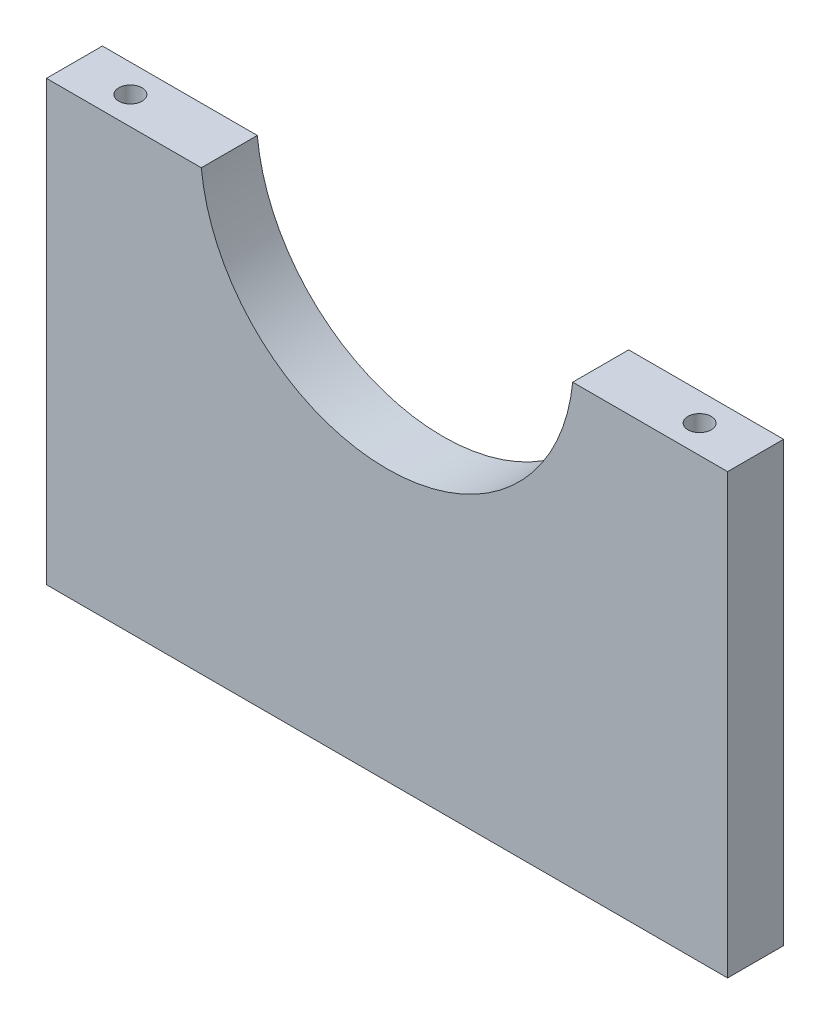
ISO-10303-21;
HEADER;
FILE_DESCRIPTION(('STEP AP214'),'2;1');
FILE_NAME('part.step','',(''),(''),'','','');
FILE_SCHEMA(('AUTOMOTIVE_DESIGN { 1 0 10303 214 1 1 1 1 }'));
ENDSEC;
DATA;
#1=APPLICATION_CONTEXT('core data for automotive mechanical design processes');
#2=APPLICATION_PROTOCOL_DEFINITION('international standard','automotive_design',2000,#1);
#3=PRODUCT_CONTEXT('',#1,'mechanical');
#4=PRODUCT('Part','Part','',(#3));
#5=PRODUCT_RELATED_PRODUCT_CATEGORY('part','',(#4));
#6=PRODUCT_DEFINITION_FORMATION('','',#4);
#7=PRODUCT_DEFINITION_CONTEXT('part definition',#1,'design');
#8=PRODUCT_DEFINITION('design','',#6,#7);
#9=PRODUCT_DEFINITION_SHAPE('','',#8);
#10=(LENGTH_UNIT() NAMED_UNIT(*) SI_UNIT(.MILLI.,.METRE.));
#11=(NAMED_UNIT(*) PLANE_ANGLE_UNIT() SI_UNIT($,.RADIAN.));
#12=(NAMED_UNIT(*) SI_UNIT($,.STERADIAN.) SOLID_ANGLE_UNIT());
#13=UNCERTAINTY_MEASURE_WITH_UNIT(LENGTH_MEASURE(1.E-05),#10,'distance_accuracy_value','');
#14=(GEOMETRIC_REPRESENTATION_CONTEXT(3) GLOBAL_UNCERTAINTY_ASSIGNED_CONTEXT((#13)) GLOBAL_UNIT_ASSIGNED_CONTEXT((#10,
#11,#12)) REPRESENTATION_CONTEXT('',''));
#15=CARTESIAN_POINT('',(0.,0.,0.));
#16=DIRECTION('',(0.,0.,1.));
#17=DIRECTION('',(1.,0.,0.));
#18=AXIS2_PLACEMENT_3D('',#15,#16,#17);
#19=CARTESIAN_POINT('',(73.,-47.,12.));
#20=DIRECTION('',(-1.,0.,0.));
#21=DIRECTION('',(0.,0.,1.));
#22=AXIS2_PLACEMENT_3D('',#19,#20,#21);
#23=PLANE('',#22);
#24=DIRECTION('',(0.,1.,0.));
#25=VECTOR('',#24,1.);
#26=CARTESIAN_POINT('',(73.,-47.,0.));
#27=LINE('',#26,#25);
#28=CARTESIAN_POINT('',(73.,-47.,0.));
#29=VERTEX_POINT('',#28);
#30=CARTESIAN_POINT('',(73.,47.,0.));
#31=VERTEX_POINT('',#30);
#32=EDGE_CURVE('E134',#29,#31,#27,.T.);
#33=ORIENTED_EDGE('',*,*,#32,.T.);
#34=DIRECTION('',(0.,0.,-1.));
#35=VECTOR('',#34,1.);
#36=CARTESIAN_POINT('',(73.,47.,12.));
#37=LINE('',#36,#35);
#38=CARTESIAN_POINT('',(73.,47.,12.));
#39=VERTEX_POINT('',#38);
#40=EDGE_CURVE('E11',#39,#31,#37,.T.);
#41=ORIENTED_EDGE('',*,*,#40,.F.);
#42=DIRECTION('',(0.,1.,0.));
#43=VECTOR('',#42,1.);
#44=CARTESIAN_POINT('',(73.,-47.,12.));
#45=LINE('',#44,#43);
#46=CARTESIAN_POINT('',(73.,-47.,12.));
#47=VERTEX_POINT('',#46);
#48=EDGE_CURVE('E145',#47,#39,#45,.T.);
#49=ORIENTED_EDGE('',*,*,#48,.F.);
#50=DIRECTION('',(0.,0.,-1.));
#51=VECTOR('',#50,1.);
#52=CARTESIAN_POINT('',(73.,-47.,12.));
#53=LINE('',#52,#51);
#54=EDGE_CURVE('E130',#47,#29,#53,.T.);
#55=ORIENTED_EDGE('',*,*,#54,.T.);
#56=EDGE_LOOP('',(#33,#41,#49,#55));
#57=FACE_BOUND('',#56,.T.);
#58=ADVANCED_FACE('F47',(#57),#23,.F.);
#59=CARTESIAN_POINT('',(39.7994974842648,47.,12.));
#60=DIRECTION('',(0.,-1.,0.));
#61=DIRECTION('',(0.,0.,-1.));
#62=AXIS2_PLACEMENT_3D('',#59,#60,#61);
#63=PLANE('',#62);
#64=CARTESIAN_POINT('',(61.,47.,6.));
#65=DIRECTION('',(0.,1.,0.));
#66=DIRECTION('',(0.,0.,1.));
#67=AXIS2_PLACEMENT_3D('',#64,#65,#66);
#68=CIRCLE('',#67,2.5);
#69=CARTESIAN_POINT('',(61.,47.,8.5));
#70=VERTEX_POINT('',#69);
#71=EDGE_CURVE('E195',#70,#70,#68,.T.);
#72=ORIENTED_EDGE('',*,*,#71,.F.);
#73=EDGE_LOOP('',(#72));
#74=FACE_BOUND('',#73,.T.);
#75=DIRECTION('',(-1.,0.,0.));
#76=VECTOR('',#75,1.);
#77=CARTESIAN_POINT('',(39.7994974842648,47.,0.));
#78=LINE('',#77,#76);
#79=CARTESIAN_POINT('',(39.7994974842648,47.,0.));
#80=VERTEX_POINT('',#79);
#81=EDGE_CURVE('E137',#31,#80,#78,.T.);
#82=ORIENTED_EDGE('',*,*,#81,.T.);
#83=DIRECTION('',(0.,0.,-1.));
#84=VECTOR('',#83,1.);
#85=CARTESIAN_POINT('',(39.7994974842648,47.,12.));
#86=LINE('',#85,#84);
#87=CARTESIAN_POINT('',(39.7994974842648,47.,12.));
#88=VERTEX_POINT('',#87);
#89=EDGE_CURVE('E55',#88,#80,#86,.T.);
#90=ORIENTED_EDGE('',*,*,#89,.F.);
#91=DIRECTION('',(-1.,0.,0.));
#92=VECTOR('',#91,1.);
#93=CARTESIAN_POINT('',(39.7994974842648,47.,12.));
#94=LINE('',#93,#92);
#95=EDGE_CURVE('E101',#39,#88,#94,.T.);
#96=ORIENTED_EDGE('',*,*,#95,.F.);
#97=ORIENTED_EDGE('',*,*,#40,.T.);
#98=EDGE_LOOP('',(#82,#90,#96,#97));
#99=FACE_BOUND('',#98,.T.);
#100=ADVANCED_FACE('F172',(#74,#99),#63,.F.);
#101=CARTESIAN_POINT('',(0.,51.,12.));
#102=DIRECTION('',(0.,0.,-1.));
#103=DIRECTION('',(-1.,0.,0.));
#104=AXIS2_PLACEMENT_3D('',#101,#102,#103);
#105=CYLINDRICAL_SURFACE('',#104,40.);
#106=CARTESIAN_POINT('',(0.,51.,0.));
#107=DIRECTION('',(0.,0.,-1.));
#108=DIRECTION('',(1.,0.,0.));
#109=AXIS2_PLACEMENT_3D('',#106,#107,#108);
#110=CIRCLE('',#109,40.);
#111=CARTESIAN_POINT('',(-39.7994974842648,47.,0.));
#112=VERTEX_POINT('',#111);
#113=EDGE_CURVE('E140',#80,#112,#110,.T.);
#114=ORIENTED_EDGE('',*,*,#113,.T.);
#115=DIRECTION('',(0.,0.,-1.));
#116=VECTOR('',#115,1.);
#117=CARTESIAN_POINT('',(-39.7994974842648,47.,12.));
#118=LINE('',#117,#116);
#119=CARTESIAN_POINT('',(-39.7994974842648,47.,12.));
#120=VERTEX_POINT('',#119);
#121=EDGE_CURVE('E125',#120,#112,#118,.T.);
#122=ORIENTED_EDGE('',*,*,#121,.F.);
#123=CARTESIAN_POINT('',(0.,51.,12.));
#124=DIRECTION('',(0.,0.,-1.));
#125=DIRECTION('',(1.,0.,0.));
#126=AXIS2_PLACEMENT_3D('',#123,#124,#125);
#127=CIRCLE('',#126,40.);
#128=EDGE_CURVE('E116',#88,#120,#127,.T.);
#129=ORIENTED_EDGE('',*,*,#128,.F.);
#130=ORIENTED_EDGE('',*,*,#89,.T.);
#131=EDGE_LOOP('',(#114,#122,#129,#130));
#132=FACE_BOUND('',#131,.T.);
#133=ADVANCED_FACE('F151',(#132),#105,.F.);
#134=CARTESIAN_POINT('',(-73.,47.,12.));
#135=DIRECTION('',(0.,-1.,0.));
#136=DIRECTION('',(0.,0.,-1.));
#137=AXIS2_PLACEMENT_3D('',#134,#135,#136);
#138=PLANE('',#137);
#139=CARTESIAN_POINT('',(-61.,47.,6.));
#140=DIRECTION('',(0.,1.,0.));
#141=DIRECTION('',(0.,0.,1.));
#142=AXIS2_PLACEMENT_3D('',#139,#140,#141);
#143=CIRCLE('',#142,2.5);
#144=CARTESIAN_POINT('',(-61.,47.,8.5));
#145=VERTEX_POINT('',#144);
#146=EDGE_CURVE('E189',#145,#145,#143,.T.);
#147=ORIENTED_EDGE('',*,*,#146,.F.);
#148=EDGE_LOOP('',(#147));
#149=FACE_BOUND('',#148,.T.);
#150=DIRECTION('',(-1.,0.,0.));
#151=VECTOR('',#150,1.);
#152=CARTESIAN_POINT('',(-73.,47.,0.));
#153=LINE('',#152,#151);
#154=CARTESIAN_POINT('',(-73.,47.,0.));
#155=VERTEX_POINT('',#154);
#156=EDGE_CURVE('E124',#112,#155,#153,.T.);
#157=ORIENTED_EDGE('',*,*,#156,.T.);
#158=DIRECTION('',(0.,0.,-1.));
#159=VECTOR('',#158,1.);
#160=CARTESIAN_POINT('',(-73.,47.,12.));
#161=LINE('',#160,#159);
#162=CARTESIAN_POINT('',(-73.,47.,12.));
#163=VERTEX_POINT('',#162);
#164=EDGE_CURVE('E121',#163,#155,#161,.T.);
#165=ORIENTED_EDGE('',*,*,#164,.F.);
#166=DIRECTION('',(-1.,0.,0.));
#167=VECTOR('',#166,1.);
#168=CARTESIAN_POINT('',(-73.,47.,12.));
#169=LINE('',#168,#167);
#170=EDGE_CURVE('E110',#120,#163,#169,.T.);
#171=ORIENTED_EDGE('',*,*,#170,.F.);
#172=ORIENTED_EDGE('',*,*,#121,.T.);
#173=EDGE_LOOP('',(#157,#165,#171,#172));
#174=FACE_BOUND('',#173,.T.);
#175=ADVANCED_FACE('F122',(#149,#174),#138,.F.);
#176=CARTESIAN_POINT('',(-73.,-47.,12.));
#177=DIRECTION('',(1.,0.,0.));
#178=DIRECTION('',(0.,0.,-1.));
#179=AXIS2_PLACEMENT_3D('',#176,#177,#178);
#180=PLANE('',#179);
#181=DIRECTION('',(0.,-1.,0.));
#182=VECTOR('',#181,1.);
#183=CARTESIAN_POINT('',(-73.,-47.,0.));
#184=LINE('',#183,#182);
#185=CARTESIAN_POINT('',(-73.,-47.,0.));
#186=VERTEX_POINT('',#185);
#187=EDGE_CURVE('E87',#155,#186,#184,.T.);
#188=ORIENTED_EDGE('',*,*,#187,.T.);
#189=DIRECTION('',(0.,0.,-1.));
#190=VECTOR('',#189,1.);
#191=CARTESIAN_POINT('',(-73.,-47.,12.));
#192=LINE('',#191,#190);
#193=CARTESIAN_POINT('',(-73.,-47.,12.));
#194=VERTEX_POINT('',#193);
#195=EDGE_CURVE('E126',#194,#186,#192,.T.);
#196=ORIENTED_EDGE('',*,*,#195,.F.);
#197=DIRECTION('',(0.,-1.,0.));
#198=VECTOR('',#197,1.);
#199=CARTESIAN_POINT('',(-73.,-47.,12.));
#200=LINE('',#199,#198);
#201=EDGE_CURVE('E114',#163,#194,#200,.T.);
#202=ORIENTED_EDGE('',*,*,#201,.F.);
#203=ORIENTED_EDGE('',*,*,#164,.T.);
#204=EDGE_LOOP('',(#188,#196,#202,#203));
#205=FACE_BOUND('',#204,.T.);
#206=ADVANCED_FACE('F128',(#205),#180,.F.);
#207=CARTESIAN_POINT('',(-73.,-47.,12.));
#208=DIRECTION('',(0.,1.,0.));
#209=DIRECTION('',(0.,0.,1.));
#210=AXIS2_PLACEMENT_3D('',#207,#208,#209);
#211=PLANE('',#210);
#212=CARTESIAN_POINT('',(-61.,-47.,6.));
#213=DIRECTION('',(0.,-1.,0.));
#214=DIRECTION('',(0.,0.,-1.));
#215=AXIS2_PLACEMENT_3D('',#212,#213,#214);
#216=CIRCLE('',#215,3.5);
#217=CARTESIAN_POINT('',(-61.,-47.,2.5));
#218=VERTEX_POINT('',#217);
#219=EDGE_CURVE('E412',#218,#218,#216,.T.);
#220=ORIENTED_EDGE('',*,*,#219,.F.);
#221=EDGE_LOOP('',(#220));
#222=FACE_BOUND('',#221,.T.);
#223=CARTESIAN_POINT('',(61.,-47.,6.));
#224=DIRECTION('',(0.,-1.,0.));
#225=DIRECTION('',(0.,0.,-1.));
#226=AXIS2_PLACEMENT_3D('',#223,#224,#225);
#227=CIRCLE('',#226,3.5);
#228=CARTESIAN_POINT('',(61.,-47.,2.5));
#229=VERTEX_POINT('',#228);
#230=EDGE_CURVE('E198',#229,#229,#227,.T.);
#231=ORIENTED_EDGE('',*,*,#230,.F.);
#232=EDGE_LOOP('',(#231));
#233=FACE_BOUND('',#232,.T.);
#234=DIRECTION('',(1.,0.,0.));
#235=VECTOR('',#234,1.);
#236=CARTESIAN_POINT('',(-73.,-47.,0.));
#237=LINE('',#236,#235);
#238=EDGE_CURVE('E93',#186,#29,#237,.T.);
#239=ORIENTED_EDGE('',*,*,#238,.T.);
#240=ORIENTED_EDGE('',*,*,#54,.F.);
#241=DIRECTION('',(1.,0.,0.));
#242=VECTOR('',#241,1.);
#243=CARTESIAN_POINT('',(-73.,-47.,12.));
#244=LINE('',#243,#242);
#245=EDGE_CURVE('E63',#194,#47,#244,.T.);
#246=ORIENTED_EDGE('',*,*,#245,.F.);
#247=ORIENTED_EDGE('',*,*,#195,.T.);
#248=EDGE_LOOP('',(#239,#240,#246,#247));
#249=FACE_BOUND('',#248,.T.);
#250=ADVANCED_FACE('F158',(#222,#233,#249),#211,.F.);
#251=CARTESIAN_POINT('',(0.,51.,12.));
#252=DIRECTION('',(0.,0.,1.));
#253=DIRECTION('',(1.,0.,0.));
#254=AXIS2_PLACEMENT_3D('',#251,#252,#253);
#255=PLANE('',#254);
#256=ORIENTED_EDGE('',*,*,#48,.T.);
#257=ORIENTED_EDGE('',*,*,#95,.T.);
#258=ORIENTED_EDGE('',*,*,#128,.T.);
#259=ORIENTED_EDGE('',*,*,#170,.T.);
#260=ORIENTED_EDGE('',*,*,#201,.T.);
#261=ORIENTED_EDGE('',*,*,#245,.T.);
#262=EDGE_LOOP('',(#256,#257,#258,#259,#260,#261));
#263=FACE_BOUND('',#262,.T.);
#264=ADVANCED_FACE('F112',(#263),#255,.T.);
#265=CARTESIAN_POINT('',(0.,51.,0.));
#266=DIRECTION('',(0.,0.,1.));
#267=DIRECTION('',(1.,0.,0.));
#268=AXIS2_PLACEMENT_3D('',#265,#266,#267);
#269=PLANE('',#268);
#270=ORIENTED_EDGE('',*,*,#32,.F.);
#271=ORIENTED_EDGE('',*,*,#238,.F.);
#272=ORIENTED_EDGE('',*,*,#187,.F.);
#273=ORIENTED_EDGE('',*,*,#156,.F.);
#274=ORIENTED_EDGE('',*,*,#113,.F.);
#275=ORIENTED_EDGE('',*,*,#81,.F.);
#276=EDGE_LOOP('',(#270,#271,#272,#273,#274,#275));
#277=FACE_BOUND('',#276,.T.);
#278=ADVANCED_FACE('F154',(#277),#269,.F.);
#279=CARTESIAN_POINT('',(61.,26.0021515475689,6.));
#280=DIRECTION('',(0.,1.,0.));
#281=DIRECTION('',(0.,0.,1.));
#282=AXIS2_PLACEMENT_3D('',#279,#280,#281);
#283=CONICAL_SURFACE('',#282,2.5,1.02974425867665);
#284=CARTESIAN_POINT('',(61.,24.5,6.));
#285=VERTEX_POINT('',#284);
#286=VERTEX_LOOP('',#285);
#287=FACE_BOUND('',#286,.T.);
#288=CARTESIAN_POINT('',(61.,26.0021515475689,6.));
#289=DIRECTION('',(0.,1.,0.));
#290=DIRECTION('',(0.,0.,1.));
#291=AXIS2_PLACEMENT_3D('',#288,#289,#290);
#292=CIRCLE('',#291,2.5);
#293=CARTESIAN_POINT('',(61.,26.0021515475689,8.5));
#294=VERTEX_POINT('',#293);
#295=EDGE_CURVE('E138',#294,#294,#292,.T.);
#296=ORIENTED_EDGE('',*,*,#295,.T.);
#297=EDGE_LOOP('',(#296));
#298=FACE_BOUND('',#297,.T.);
#299=ADVANCED_FACE('F209',(#287,#298),#283,.F.);
#300=CARTESIAN_POINT('',(61.,47.,6.));
#301=DIRECTION('',(0.,1.,0.));
#302=DIRECTION('',(0.,0.,1.));
#303=AXIS2_PLACEMENT_3D('',#300,#301,#302);
#304=CYLINDRICAL_SURFACE('',#303,2.5);
#305=ORIENTED_EDGE('',*,*,#295,.F.);
#306=EDGE_LOOP('',(#305));
#307=FACE_BOUND('',#306,.T.);
#308=ORIENTED_EDGE('',*,*,#71,.T.);
#309=EDGE_LOOP('',(#308));
#310=FACE_BOUND('',#309,.T.);
#311=ADVANCED_FACE('F211',(#307,#310),#304,.F.);
#312=CARTESIAN_POINT('',(-61.,26.0021515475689,6.));
#313=DIRECTION('',(0.,1.,0.));
#314=DIRECTION('',(0.,0.,1.));
#315=AXIS2_PLACEMENT_3D('',#312,#313,#314);
#316=CONICAL_SURFACE('',#315,2.5,1.02974425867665);
#317=CARTESIAN_POINT('',(-61.,24.5,6.));
#318=VERTEX_POINT('',#317);
#319=VERTEX_LOOP('',#318);
#320=FACE_BOUND('',#319,.T.);
#321=CARTESIAN_POINT('',(-61.,26.0021515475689,6.));
#322=DIRECTION('',(0.,1.,0.));
#323=DIRECTION('',(0.,0.,1.));
#324=AXIS2_PLACEMENT_3D('',#321,#322,#323);
#325=CIRCLE('',#324,2.5);
#326=CARTESIAN_POINT('',(-61.,26.0021515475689,8.49999999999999));
#327=VERTEX_POINT('',#326);
#328=EDGE_CURVE('E191',#327,#327,#325,.T.);
#329=ORIENTED_EDGE('',*,*,#328,.T.);
#330=EDGE_LOOP('',(#329));
#331=FACE_BOUND('',#330,.T.);
#332=ADVANCED_FACE('F214',(#320,#331),#316,.F.);
#333=CARTESIAN_POINT('',(-61.,47.,6.));
#334=DIRECTION('',(0.,1.,0.));
#335=DIRECTION('',(0.,0.,1.));
#336=AXIS2_PLACEMENT_3D('',#333,#334,#335);
#337=CYLINDRICAL_SURFACE('',#336,2.5);
#338=ORIENTED_EDGE('',*,*,#328,.F.);
#339=EDGE_LOOP('',(#338));
#340=FACE_BOUND('',#339,.T.);
#341=ORIENTED_EDGE('',*,*,#146,.T.);
#342=EDGE_LOOP('',(#341));
#343=FACE_BOUND('',#342,.T.);
#344=ADVANCED_FACE('F220',(#340,#343),#337,.F.);
#345=CARTESIAN_POINT('',(61.,-21.,6.));
#346=DIRECTION('',(0.,-1.,0.));
#347=DIRECTION('',(0.,0.,-1.));
#348=AXIS2_PLACEMENT_3D('',#345,#346,#347);
#349=CONICAL_SURFACE('',#348,3.49999999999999,1.02974425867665);
#350=CARTESIAN_POINT('',(61.,-18.8969878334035,6.));
#351=VERTEX_POINT('',#350);
#352=VERTEX_LOOP('',#351);
#353=FACE_BOUND('',#352,.T.);
#354=CARTESIAN_POINT('',(61.,-21.,6.));
#355=DIRECTION('',(0.,-1.,0.));
#356=DIRECTION('',(0.,0.,-1.));
#357=AXIS2_PLACEMENT_3D('',#354,#355,#356);
#358=CIRCLE('',#357,3.49999999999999);
#359=CARTESIAN_POINT('',(61.,-21.,2.50000000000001));
#360=VERTEX_POINT('',#359);
#361=EDGE_CURVE('E192',#360,#360,#358,.T.);
#362=ORIENTED_EDGE('',*,*,#361,.T.);
#363=EDGE_LOOP('',(#362));
#364=FACE_BOUND('',#363,.T.);
#365=ADVANCED_FACE('F266',(#353,#364),#349,.F.);
#366=CARTESIAN_POINT('',(61.,-47.,6.));
#367=DIRECTION('',(0.,-1.,0.));
#368=DIRECTION('',(0.,0.,-1.));
#369=AXIS2_PLACEMENT_3D('',#366,#367,#368);
#370=CYLINDRICAL_SURFACE('',#369,3.5);
#371=ORIENTED_EDGE('',*,*,#361,.F.);
#372=EDGE_LOOP('',(#371));
#373=FACE_BOUND('',#372,.T.);
#374=ORIENTED_EDGE('',*,*,#230,.T.);
#375=EDGE_LOOP('',(#374));
#376=FACE_BOUND('',#375,.T.);
#377=ADVANCED_FACE('F288',(#373,#376),#370,.F.);
#378=CARTESIAN_POINT('',(-61.,-21.,6.));
#379=DIRECTION('',(0.,-1.,0.));
#380=DIRECTION('',(0.,0.,-1.));
#381=AXIS2_PLACEMENT_3D('',#378,#379,#380);
#382=CONICAL_SURFACE('',#381,3.5,1.02974425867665);
#383=CARTESIAN_POINT('',(-61.,-18.8969878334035,6.));
#384=VERTEX_POINT('',#383);
#385=VERTEX_LOOP('',#384);
#386=FACE_BOUND('',#385,.T.);
#387=CARTESIAN_POINT('',(-61.,-21.,6.));
#388=DIRECTION('',(0.,-1.,0.));
#389=DIRECTION('',(0.,0.,-1.));
#390=AXIS2_PLACEMENT_3D('',#387,#388,#389);
#391=CIRCLE('',#390,3.5);
#392=CARTESIAN_POINT('',(-61.,-21.,2.5));
#393=VERTEX_POINT('',#392);
#394=EDGE_CURVE('E410',#393,#393,#391,.T.);
#395=ORIENTED_EDGE('',*,*,#394,.T.);
#396=EDGE_LOOP('',(#395));
#397=FACE_BOUND('',#396,.T.);
#398=ADVANCED_FACE('F299',(#386,#397),#382,.F.);
#399=CARTESIAN_POINT('',(-61.,-47.,6.));
#400=DIRECTION('',(0.,-1.,0.));
#401=DIRECTION('',(0.,0.,-1.));
#402=AXIS2_PLACEMENT_3D('',#399,#400,#401);
#403=CYLINDRICAL_SURFACE('',#402,3.5);
#404=ORIENTED_EDGE('',*,*,#394,.F.);
#405=EDGE_LOOP('',(#404));
#406=FACE_BOUND('',#405,.T.);
#407=ORIENTED_EDGE('',*,*,#219,.T.);
#408=EDGE_LOOP('',(#407));
#409=FACE_BOUND('',#408,.T.);
#410=ADVANCED_FACE('F312',(#406,#409),#403,.F.);
#411=CLOSED_SHELL('',(#58,#100,#133,#175,#206,#250,#264,#278,#299,#311,#332,#344,#365,#377,#398,#410));
#412=MANIFOLD_SOLID_BREP('B2',#411);
#413=ADVANCED_BREP_SHAPE_REPRESENTATION('',(#18,#412),#14);
#414=SHAPE_DEFINITION_REPRESENTATION(#9,#413);
ENDSEC;
END-ISO-10303-21;
